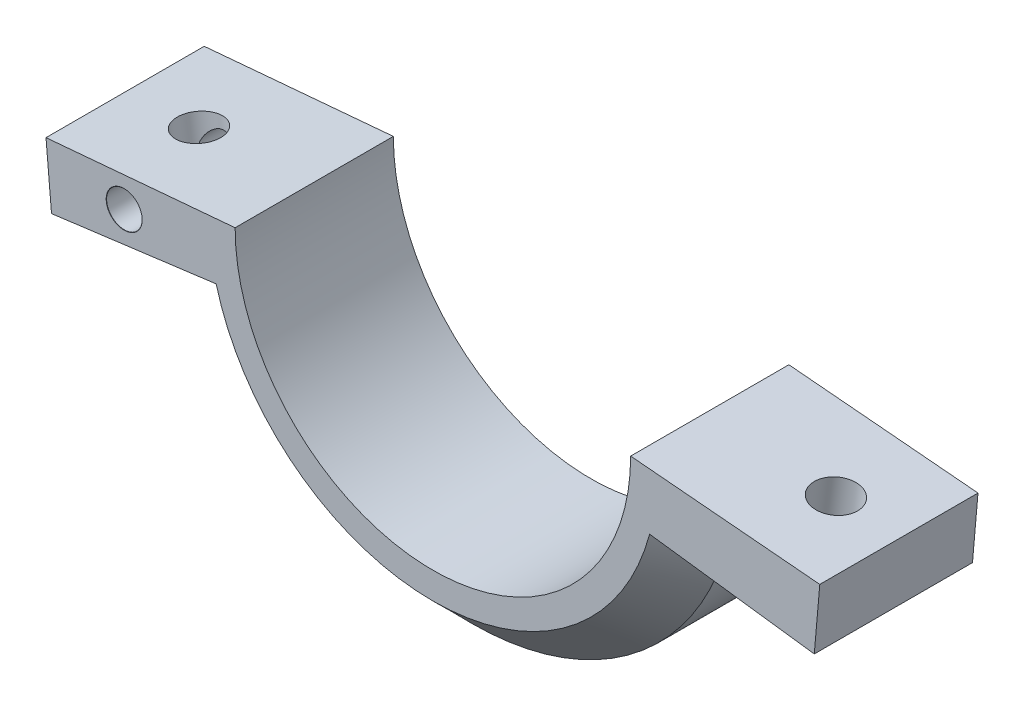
from build123d import *

# Parameters (mm, degrees)
EXTRUDE_1_DEPTH                       = 20
CHAMFER_1_SIZE                        = 5
HOLE_WIZARD_M51_D                     = 5.5
HOLE_WIZARD_M51_CSINK_D               = 5.55
HOLE_WIZARD_M51_CSINK_ANGLE           = 90
HOLE_WIZARD_M51_ON_FACE_2_D           = 5.5
HOLE_WIZARD_M51_ON_FACE_2_CSINK_D     = 5.55
HOLE_WIZARD_M51_ON_FACE_2_CSINK_ANGLE = 90
HOLE_WIZARD_M42_D                     = 4.5
HOLE_WIZARD_M42_CSINK_D               = 4.55
HOLE_WIZARD_M42_CSINK_ANGLE           = 90


with BuildPart() as part:
    # Sketch 1 → Extrude 1 (new body)
    with BuildSketch(Plane.XY):
        with BuildLine():
            Line((-32.393465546, 51.241067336), (-48.211426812, 49.179771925))
            Line((-48.211426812, 49.179771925), (-48.908672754, 57.14932951))
            Line((-48.908672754, 57.14932951), (-25, 59.241067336))
            ThreePointArc((-25, 59.241067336), (0, 34.241067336), (25, 59.241067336))
            Line((25, 59.241067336), (48.908672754, 57.14932951))
            Line((48.908672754, 57.14932951), (48.211426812, 49.179771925))
            Line((48.211426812, 49.179771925), (32.393465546, 51.241067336))
            ThreePointArc((32.393465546, 51.241067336), (0, 25.874368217), (-32.393465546, 51.241067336))
        make_face()
    extrude(amount=-EXTRUDE_1_DEPTH)

    # Chamfer 1
    chamfer_1_edges = [part.edges().sort_by_distance(p)[0] for p in [
        (0, 25.874368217, -20),
        (0, 25.874368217, 0),
    ]]
    chamfer(chamfer_1_edges, length=CHAMFER_1_SIZE)

    # Hole Wizard M51 (through all)
    with Locations(Plane(origin=(39.977010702, 50.252828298, -9.983036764), x_dir=(-0.991615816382, 0.129221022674, 0), z_dir=(-0.129221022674, -0.991615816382, 0))):
        with Locations((0, 0)):
            CounterSinkHole(HOLE_WIZARD_M51_D / 2, HOLE_WIZARD_M51_CSINK_D / 2, counter_sink_angle=HOLE_WIZARD_M51_CSINK_ANGLE)

    # Hole Wizard M51 on face 2 (through all)
    with Locations(Plane(origin=(-38.565750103, 50.436734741, -9.979379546), x_dir=(-0.991615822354, -0.12922097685, 0), z_dir=(0.12922097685, -0.991615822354, 0))):
        with Locations((0, 0)):
            CounterSinkHole(HOLE_WIZARD_M51_ON_FACE_2_D / 2, HOLE_WIZARD_M51_ON_FACE_2_CSINK_D / 2, counter_sink_angle=HOLE_WIZARD_M51_ON_FACE_2_CSINK_ANGLE)

    # Hole Wizard M42 (through all)
    with Locations(Plane.XY):
        with Locations((-39.023981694, 54.23377627)):
            CounterSinkHole(HOLE_WIZARD_M42_D / 2, HOLE_WIZARD_M42_CSINK_D / 2, counter_sink_angle=HOLE_WIZARD_M42_CSINK_ANGLE)


solid = part.part
